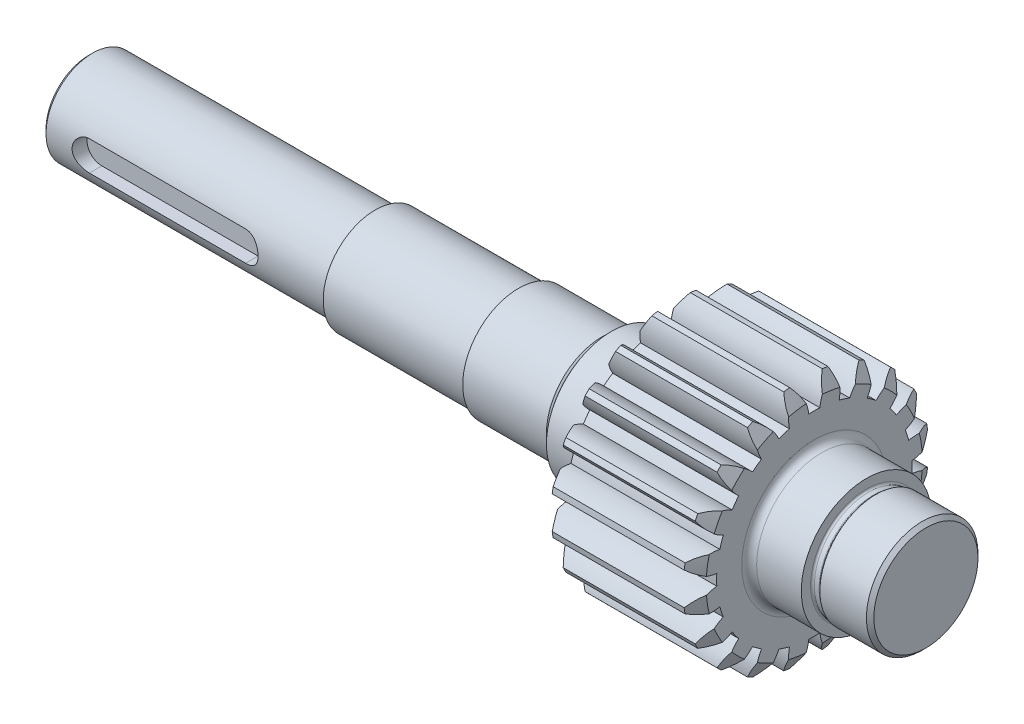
from build123d import *

# Parameters (mm, degrees)
BASPROSKE_W        = 40
BASPROSKE_H        = 33
TOOTHCUT_DEPTH     = 62.465437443
TEETHCUTS_COUNT    = 20
TEETHCUTS_ANGLE    = 342
CHAMFER1_SIZE      = 1
CUT_EXTRUDE1_DEPTH = 4
FILLET1_R          = 0.5
FILLET2_R          = 2
FILLET3_R          = 0.5


with BuildPart() as part:
    # BasProSke → Base-Revolve (revolve)
    with BuildSketch(Plane(origin=(0, 0, 0), x_dir=(1, 0, 0), z_dir=(0, 1, 0)), mode=Mode.PRIVATE) as base_revolve_sk:
        with Locations((20, 16.5)):
            Rectangle(BASPROSKE_W, BASPROSKE_H)
    revolve(base_revolve_sk.sketch.rotate(Axis((-10, 0, 0), (1, 0, 0)), 180), axis=Axis((-10, 0, 0), (1, 0, 0)))

    # TooCutSke → ToothCut (cut, through all)
    with BuildSketch(Plane(origin=(0, 0, 0), x_dir=(0, 0, -1), z_dir=(1, 0, 0))):
        with BuildLine():
            ThreePointArc((1.489278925, 26.206717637), (0, 26.249), (-1.489278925, 26.206717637))
            ThreePointArc((-1.489278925, 26.206717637), (-2.448651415, 29.690511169), (-4.401620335, 32.730762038))
            ThreePointArc((-4.401620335, 32.730762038), (0, 33.0254), (4.401620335, 32.730762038))
            ThreePointArc((4.401620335, 32.730762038), (2.448651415, 29.690511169), (1.489278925, 26.206717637))
        make_face()
    toothcut = extrude(amount=TOOTHCUT_DEPTH, mode=Mode.SUBTRACT)

    # TeethCuts: ToothCut ×20 about axis
    teethcuts_axis = Axis((-10, 0, 0), (1, 0, 0))
    for i in range(1, TEETHCUTS_COUNT):
        add(toothcut.rotate(teethcuts_axis, i * TEETHCUTS_ANGLE / (TEETHCUTS_COUNT - 1)), mode=Mode.SUBTRACT)

    # Sketch1 → Revolve1 (revolve)
    with BuildSketch(Plane.XY, mode=Mode.PRIVATE) as revolve1_sk:
        Polygon((40, 0), (40, 17.5), (54, 17.5), (54, 15), (70, 15), (70, 0), align=None)
        Polygon((0, 0), (0, 17.5), (-14.5, 17.5), (-14.5, 15), (-39.5, 15), (-39.5, 14), (-78, 14), (-78, 12.5), (-155, 12.5), (-155, 0), align=None)
    revolve(revolve1_sk.sketch.rotate(Axis((199.554039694, 0, 0), (-1, 0, 0)), 90), axis=Axis((199.554039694, 0, 0), (-1, 0, 0)))

    # Chamfer1
    chamfer1_edges = [part.edges().sort_by_distance(p)[0] for p in [
        (70, 0, 15),
        (-155, 0, 12.5),
    ]]
    chamfer(chamfer1_edges, length=CHAMFER1_SIZE)

    # Sketch2 → Cut-Revolve1 (revolve, cut)
    with BuildSketch(Plane.XY, mode=Mode.PRIVATE) as cut_revolve1_sk:
        Polygon((40.5, 33.207837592), (40.5, 28.207837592), (37.613248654, 33.207837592), align=None)
        Polygon((2.386751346, 33.207837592), (-0.5, 33.207837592), (-0.5, 28.207837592), align=None)
    revolve(cut_revolve1_sk.sketch.rotate(Axis((101.748417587, 0, 0), (-1, 0, 0)), 270), axis=Axis((101.748417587, 0, 0), (-1, 0, 0)), mode=Mode.SUBTRACT)

    # Sketch3 → Cut-Extrude1 (cut)
    with BuildSketch(Plane.XY.offset(12.5)):
        with BuildLine():
            Line((-143, 4), (-101, 4))
            ThreePointArc((-101, 4), (-97, 0), (-101, -4))
            Line((-101, -4), (-143, -4))
            ThreePointArc((-143, -4), (-147, 0), (-143, 4))
        make_face()
    extrude(amount=-CUT_EXTRUDE1_DEPTH, mode=Mode.SUBTRACT)

    # Sketch4 → Cut-Revolve2 (revolve, cut)
    with BuildSketch(Plane.XY, mode=Mode.PRIVATE) as cut_revolve2_sk:
        Polygon((54, 15), (54, 14.5), (56, 14.5), (56.5, 15), align=None)
    revolve(cut_revolve2_sk.sketch.rotate(Axis((115.928794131, 0, 0), (-1, 0, 0)), 90), axis=Axis((115.928794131, 0, 0), (-1, 0, 0)), mode=Mode.SUBTRACT)

    # Sketch5 → Cut-Revolve3 (revolve, cut)
    with BuildSketch(Plane.XY, mode=Mode.PRIVATE) as cut_revolve3_sk:
        Polygon((-14.5, 15), (-14.5, 14.5), (-16.5, 14.5), (-17, 15), align=None)
    revolve(cut_revolve3_sk.sketch.rotate(Axis((-173.319765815, 0, 0), (1, 0, 0)), 90), axis=Axis((-173.319765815, 0, 0), (1, 0, 0)), mode=Mode.SUBTRACT)

    # Fillet1
    fillet1_edges = [part.edges().sort_by_distance(p)[0] for p in [
        (54, 0, 14.5),
        (56, 0, 14.5),
        (-14.5, 0, -14.5),
        (-16.5, 0, -14.5),
    ]]
    fillet(fillet1_edges, radius=FILLET1_R)

    # Fillet2
    fillet2_edges = [part.edges().sort_by_distance(p)[0] for p in [
        (40, 0, 17.5),
        (0, 0, 17.5),
    ]]
    fillet(fillet2_edges, radius=FILLET2_R)

    # Fillet3
    fillet3_edges = [part.edges().sort_by_distance(p)[0] for p in [
        (-78, 0, 12.5),
    ]]
    fillet(fillet3_edges, radius=FILLET3_R)


solid = part.part
